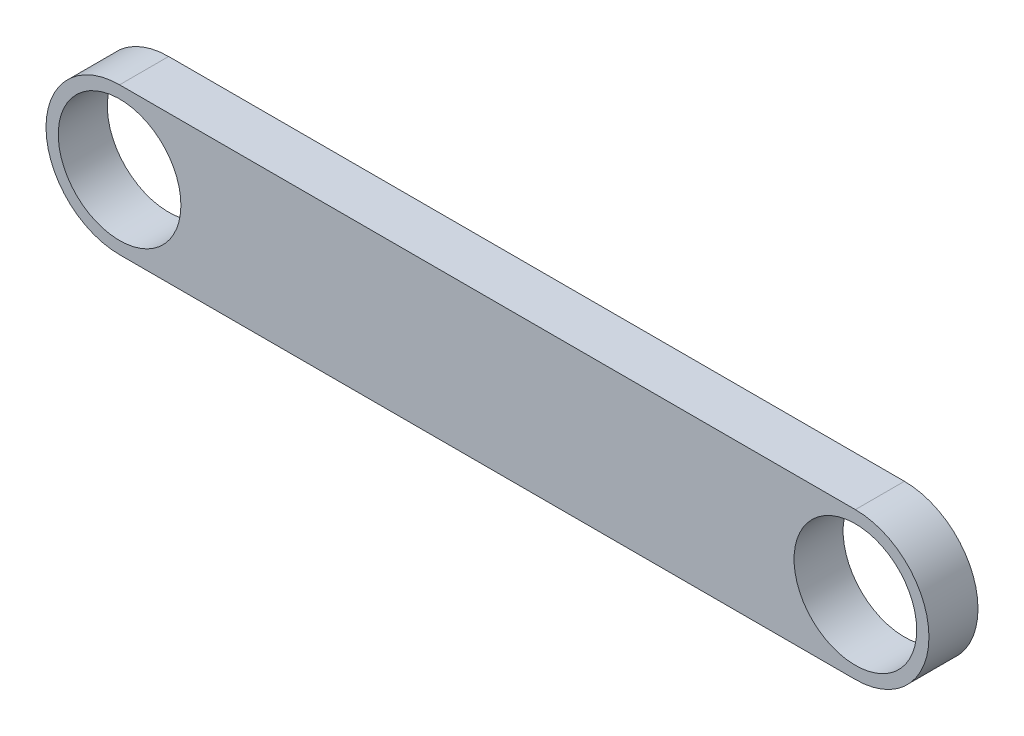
from build123d import *

# Parameters (mm, degrees)
SKETCH1_R           = 12.5
BOSS_EXTRUDE1_DEPTH = 10


with BuildPart() as part:
    # Sketch1 → Boss-Extrude1 (new body)
    with BuildSketch(Plane.XY):
        with BuildLine():
            Line((0, 15), (150, 15))
            ThreePointArc((150, 15), (165, 0), (150, -15))
            Line((150, -15), (0, -15))
            ThreePointArc((0, -15), (-15, 0), (0, 15))
        make_face()
        Circle(SKETCH1_R, mode=Mode.SUBTRACT)
        with Locations((150, 0)):
            Circle(SKETCH1_R, mode=Mode.SUBTRACT)
    extrude(amount=BOSS_EXTRUDE1_DEPTH)


solid = part.part
